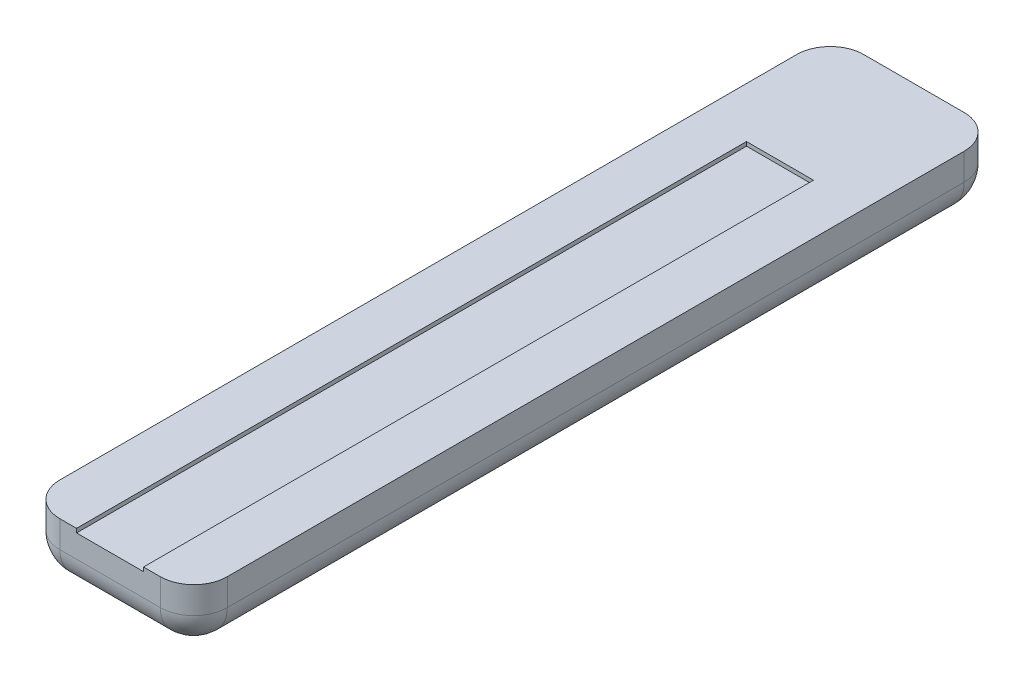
ISO-10303-21;
HEADER;
FILE_DESCRIPTION(('STEP AP214'),'2;1');
FILE_NAME('part.step','',(''),(''),'','','');
FILE_SCHEMA(('AUTOMOTIVE_DESIGN { 1 0 10303 214 1 1 1 1 }'));
ENDSEC;
DATA;
#1=APPLICATION_CONTEXT('core data for automotive mechanical design processes');
#2=APPLICATION_PROTOCOL_DEFINITION('international standard','automotive_design',2000,#1);
#3=PRODUCT_CONTEXT('',#1,'mechanical');
#4=PRODUCT('Part','Part','',(#3));
#5=PRODUCT_RELATED_PRODUCT_CATEGORY('part','',(#4));
#6=PRODUCT_DEFINITION_FORMATION('','',#4);
#7=PRODUCT_DEFINITION_CONTEXT('part definition',#1,'design');
#8=PRODUCT_DEFINITION('design','',#6,#7);
#9=PRODUCT_DEFINITION_SHAPE('','',#8);
#10=(LENGTH_UNIT() NAMED_UNIT(*) SI_UNIT(.MILLI.,.METRE.));
#11=(NAMED_UNIT(*) PLANE_ANGLE_UNIT() SI_UNIT($,.RADIAN.));
#12=(NAMED_UNIT(*) SI_UNIT($,.STERADIAN.) SOLID_ANGLE_UNIT());
#13=UNCERTAINTY_MEASURE_WITH_UNIT(LENGTH_MEASURE(1.E-05),#10,'distance_accuracy_value','');
#14=(GEOMETRIC_REPRESENTATION_CONTEXT(3) GLOBAL_UNCERTAINTY_ASSIGNED_CONTEXT((#13)) GLOBAL_UNIT_ASSIGNED_CONTEXT((#10,
#11,#12)) REPRESENTATION_CONTEXT('',''));
#15=CARTESIAN_POINT('',(0.,0.,0.));
#16=DIRECTION('',(0.,0.,1.));
#17=DIRECTION('',(1.,0.,0.));
#18=AXIS2_PLACEMENT_3D('',#15,#16,#17);
#19=CARTESIAN_POINT('',(-15.875,-11.43,0.));
#20=DIRECTION('',(-1.,0.,0.));
#21=DIRECTION('',(0.,0.,1.));
#22=AXIS2_PLACEMENT_3D('',#19,#20,#21);
#23=PLANE('',#22);
#24=DIRECTION('',(0.,1.,0.));
#25=VECTOR('',#24,1.);
#26=CARTESIAN_POINT('',(-15.875,-11.43,-146.05));
#27=LINE('',#26,#25);
#28=CARTESIAN_POINT('',(-15.875,0.,-146.05));
#29=VERTEX_POINT('',#28);
#30=CARTESIAN_POINT('',(-15.875,-5.08,-146.05));
#31=VERTEX_POINT('',#30);
#32=EDGE_CURVE('E207',#29,#31,#27,.F.);
#33=ORIENTED_EDGE('',*,*,#32,.T.);
#34=DIRECTION('',(0.,0.,1.));
#35=VECTOR('',#34,1.);
#36=CARTESIAN_POINT('',(-15.875,-5.08,0.));
#37=LINE('',#36,#35);
#38=CARTESIAN_POINT('',(-15.875,-5.08,-6.35));
#39=VERTEX_POINT('',#38);
#40=EDGE_CURVE('E217',#31,#39,#37,.T.);
#41=ORIENTED_EDGE('',*,*,#40,.T.);
#42=DIRECTION('',(0.,1.,0.));
#43=VECTOR('',#42,1.);
#44=CARTESIAN_POINT('',(-15.875,-11.43,-6.35));
#45=LINE('',#44,#43);
#46=CARTESIAN_POINT('',(-15.875,0.,-6.35));
#47=VERTEX_POINT('',#46);
#48=EDGE_CURVE('E205',#39,#47,#45,.T.);
#49=ORIENTED_EDGE('',*,*,#48,.T.);
#50=DIRECTION('',(0.,0.,1.));
#51=VECTOR('',#50,1.);
#52=CARTESIAN_POINT('',(-15.875,0.,0.));
#53=LINE('',#52,#51);
#54=EDGE_CURVE('E175',#29,#47,#53,.T.);
#55=ORIENTED_EDGE('',*,*,#54,.F.);
#56=EDGE_LOOP('',(#33,#41,#49,#55));
#57=FACE_BOUND('',#56,.T.);
#58=ADVANCED_FACE('F33',(#57),#23,.T.);
#59=CARTESIAN_POINT('',(-15.875,-11.43,-152.4));
#60=DIRECTION('',(0.,0.,-1.));
#61=DIRECTION('',(-1.,0.,0.));
#62=AXIS2_PLACEMENT_3D('',#59,#60,#61);
#63=PLANE('',#62);
#64=DIRECTION('',(0.,1.,0.));
#65=VECTOR('',#64,1.);
#66=CARTESIAN_POINT('',(9.525,-11.43,-152.4));
#67=LINE('',#66,#65);
#68=CARTESIAN_POINT('',(9.525,0.,-152.4));
#69=VERTEX_POINT('',#68);
#70=CARTESIAN_POINT('',(9.525,-5.08,-152.4));
#71=VERTEX_POINT('',#70);
#72=EDGE_CURVE('E202',#69,#71,#67,.F.);
#73=ORIENTED_EDGE('',*,*,#72,.T.);
#74=DIRECTION('',(-1.,0.,0.));
#75=VECTOR('',#74,1.);
#76=CARTESIAN_POINT('',(-15.875,-5.08,-152.4));
#77=LINE('',#76,#75);
#78=CARTESIAN_POINT('',(-9.525,-5.08,-152.4));
#79=VERTEX_POINT('',#78);
#80=EDGE_CURVE('E230',#71,#79,#77,.T.);
#81=ORIENTED_EDGE('',*,*,#80,.T.);
#82=DIRECTION('',(0.,1.,0.));
#83=VECTOR('',#82,1.);
#84=CARTESIAN_POINT('',(-9.525,-11.43,-152.4));
#85=LINE('',#84,#83);
#86=CARTESIAN_POINT('',(-9.525,0.,-152.4));
#87=VERTEX_POINT('',#86);
#88=EDGE_CURVE('E200',#79,#87,#85,.T.);
#89=ORIENTED_EDGE('',*,*,#88,.T.);
#90=DIRECTION('',(-1.,0.,0.));
#91=VECTOR('',#90,1.);
#92=CARTESIAN_POINT('',(-15.875,0.,-152.4));
#93=LINE('',#92,#91);
#94=EDGE_CURVE('E184',#69,#87,#93,.T.);
#95=ORIENTED_EDGE('',*,*,#94,.F.);
#96=EDGE_LOOP('',(#73,#81,#89,#95));
#97=FACE_BOUND('',#96,.T.);
#98=ADVANCED_FACE('F273',(#97),#63,.T.);
#99=CARTESIAN_POINT('',(15.875,-11.43,0.));
#100=DIRECTION('',(1.,0.,0.));
#101=DIRECTION('',(0.,0.,-1.));
#102=AXIS2_PLACEMENT_3D('',#99,#100,#101);
#103=PLANE('',#102);
#104=DIRECTION('',(0.,1.,0.));
#105=VECTOR('',#104,1.);
#106=CARTESIAN_POINT('',(15.875,-11.43,-6.35));
#107=LINE('',#106,#105);
#108=CARTESIAN_POINT('',(15.875,0.,-6.35));
#109=VERTEX_POINT('',#108);
#110=CARTESIAN_POINT('',(15.875,-5.08,-6.35));
#111=VERTEX_POINT('',#110);
#112=EDGE_CURVE('E187',#109,#111,#107,.F.);
#113=ORIENTED_EDGE('',*,*,#112,.T.);
#114=DIRECTION('',(0.,0.,-1.));
#115=VECTOR('',#114,1.);
#116=CARTESIAN_POINT('',(15.875,-5.08,0.));
#117=LINE('',#116,#115);
#118=CARTESIAN_POINT('',(15.875,-5.08,-146.05));
#119=VERTEX_POINT('',#118);
#120=EDGE_CURVE('E234',#111,#119,#117,.T.);
#121=ORIENTED_EDGE('',*,*,#120,.T.);
#122=DIRECTION('',(0.,1.,0.));
#123=VECTOR('',#122,1.);
#124=CARTESIAN_POINT('',(15.875,-11.43,-146.05));
#125=LINE('',#124,#123);
#126=CARTESIAN_POINT('',(15.875,0.,-146.05));
#127=VERTEX_POINT('',#126);
#128=EDGE_CURVE('E190',#119,#127,#125,.T.);
#129=ORIENTED_EDGE('',*,*,#128,.T.);
#130=DIRECTION('',(0.,0.,-1.));
#131=VECTOR('',#130,1.);
#132=CARTESIAN_POINT('',(15.875,0.,0.));
#133=LINE('',#132,#131);
#134=EDGE_CURVE('E181',#109,#127,#133,.T.);
#135=ORIENTED_EDGE('',*,*,#134,.F.);
#136=EDGE_LOOP('',(#113,#121,#129,#135));
#137=FACE_BOUND('',#136,.T.);
#138=ADVANCED_FACE('F283',(#137),#103,.T.);
#139=CARTESIAN_POINT('',(-15.875,-11.43,0.));
#140=DIRECTION('',(0.,0.,1.));
#141=DIRECTION('',(1.,0.,0.));
#142=AXIS2_PLACEMENT_3D('',#139,#140,#141);
#143=PLANE('',#142);
#144=DIRECTION('',(0.,1.,0.));
#145=VECTOR('',#144,1.);
#146=CARTESIAN_POINT('',(-6.34999999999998,-0.762,0.));
#147=LINE('',#146,#145);
#148=CARTESIAN_POINT('',(-6.34999999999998,-0.762,0.));
#149=VERTEX_POINT('',#148);
#150=CARTESIAN_POINT('',(-6.34999999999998,0.,0.));
#151=VERTEX_POINT('',#150);
#152=EDGE_CURVE('E137',#149,#151,#147,.T.);
#153=ORIENTED_EDGE('',*,*,#152,.T.);
#154=DIRECTION('',(1.,0.,0.));
#155=VECTOR('',#154,1.);
#156=CARTESIAN_POINT('',(-15.875,0.,0.));
#157=LINE('',#156,#155);
#158=CARTESIAN_POINT('',(-9.525,0.,0.));
#159=VERTEX_POINT('',#158);
#160=EDGE_CURVE('E179',#159,#151,#157,.T.);
#161=ORIENTED_EDGE('',*,*,#160,.F.);
#162=DIRECTION('',(0.,1.,0.));
#163=VECTOR('',#162,1.);
#164=CARTESIAN_POINT('',(-9.525,-11.43,0.));
#165=LINE('',#164,#163);
#166=CARTESIAN_POINT('',(-9.525,-5.08,0.));
#167=VERTEX_POINT('',#166);
#168=EDGE_CURVE('E212',#159,#167,#165,.F.);
#169=ORIENTED_EDGE('',*,*,#168,.T.);
#170=DIRECTION('',(1.,0.,0.));
#171=VECTOR('',#170,1.);
#172=CARTESIAN_POINT('',(-15.875,-5.08,0.));
#173=LINE('',#172,#171);
#174=CARTESIAN_POINT('',(9.525,-5.08,0.));
#175=VERTEX_POINT('',#174);
#176=EDGE_CURVE('E11',#167,#175,#173,.T.);
#177=ORIENTED_EDGE('',*,*,#176,.T.);
#178=DIRECTION('',(0.,1.,0.));
#179=VECTOR('',#178,1.);
#180=CARTESIAN_POINT('',(9.525,-11.43,0.));
#181=LINE('',#180,#179);
#182=CARTESIAN_POINT('',(9.525,0.,0.));
#183=VERTEX_POINT('',#182);
#184=EDGE_CURVE('E210',#175,#183,#181,.T.);
#185=ORIENTED_EDGE('',*,*,#184,.T.);
#186=CARTESIAN_POINT('',(6.35000000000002,0.,0.));
#187=VERTEX_POINT('',#186);
#188=EDGE_CURVE('E178',#187,#183,#157,.T.);
#189=ORIENTED_EDGE('',*,*,#188,.F.);
#190=DIRECTION('',(0.,1.,0.));
#191=VECTOR('',#190,1.);
#192=CARTESIAN_POINT('',(6.35000000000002,-0.762,0.));
#193=LINE('',#192,#191);
#194=CARTESIAN_POINT('',(6.35000000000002,-0.762,0.));
#195=VERTEX_POINT('',#194);
#196=EDGE_CURVE('E50',#195,#187,#193,.T.);
#197=ORIENTED_EDGE('',*,*,#196,.F.);
#198=DIRECTION('',(1.,0.,0.));
#199=VECTOR('',#198,1.);
#200=CARTESIAN_POINT('',(-6.34999999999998,-0.762,0.));
#201=LINE('',#200,#199);
#202=EDGE_CURVE('E153',#149,#195,#201,.T.);
#203=ORIENTED_EDGE('',*,*,#202,.F.);
#204=EDGE_LOOP('',(#153,#161,#169,#177,#185,#189,#197,#203));
#205=FACE_BOUND('',#204,.T.);
#206=ADVANCED_FACE('F157',(#205),#143,.T.);
#207=CARTESIAN_POINT('',(-15.875,-11.43,-152.4));
#208=DIRECTION('',(0.,-1.,0.));
#209=DIRECTION('',(0.,0.,-1.));
#210=AXIS2_PLACEMENT_3D('',#207,#208,#209);
#211=PLANE('',#210);
#212=DIRECTION('',(1.,0.,0.));
#213=VECTOR('',#212,1.);
#214=CARTESIAN_POINT('',(-15.875,-11.43,-6.34999999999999));
#215=LINE('',#214,#213);
#216=CARTESIAN_POINT('',(9.525,-11.43,-6.35));
#217=VERTEX_POINT('',#216);
#218=CARTESIAN_POINT('',(-9.525,-11.43,-6.35));
#219=VERTEX_POINT('',#218);
#220=EDGE_CURVE('E219',#217,#219,#215,.F.);
#221=ORIENTED_EDGE('',*,*,#220,.T.);
#222=DIRECTION('',(0.,0.,1.));
#223=VECTOR('',#222,1.);
#224=CARTESIAN_POINT('',(-9.525,-11.43,-152.4));
#225=LINE('',#224,#223);
#226=CARTESIAN_POINT('',(-9.525,-11.43,-146.05));
#227=VERTEX_POINT('',#226);
#228=EDGE_CURVE('E225',#219,#227,#225,.F.);
#229=ORIENTED_EDGE('',*,*,#228,.T.);
#230=DIRECTION('',(-1.,0.,0.));
#231=VECTOR('',#230,1.);
#232=CARTESIAN_POINT('',(-15.875,-11.43,-146.05));
#233=LINE('',#232,#231);
#234=CARTESIAN_POINT('',(9.525,-11.43,-146.05));
#235=VERTEX_POINT('',#234);
#236=EDGE_CURVE('E223',#227,#235,#233,.F.);
#237=ORIENTED_EDGE('',*,*,#236,.T.);
#238=DIRECTION('',(0.,0.,-1.));
#239=VECTOR('',#238,1.);
#240=CARTESIAN_POINT('',(9.525,-11.43,-152.4));
#241=LINE('',#240,#239);
#242=EDGE_CURVE('E221',#235,#217,#241,.F.);
#243=ORIENTED_EDGE('',*,*,#242,.T.);
#244=EDGE_LOOP('',(#221,#229,#237,#243));
#245=FACE_BOUND('',#244,.T.);
#246=ADVANCED_FACE('F296',(#245),#211,.T.);
#247=CARTESIAN_POINT('',(-15.875,0.,-152.4));
#248=DIRECTION('',(0.,-1.,0.));
#249=DIRECTION('',(0.,0.,-1.));
#250=AXIS2_PLACEMENT_3D('',#247,#248,#249);
#251=PLANE('',#250);
#252=ORIENTED_EDGE('',*,*,#160,.T.);
#253=DIRECTION('',(0.,0.,1.));
#254=VECTOR('',#253,1.);
#255=CARTESIAN_POINT('',(-6.34999999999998,0.,0.));
#256=LINE('',#255,#254);
#257=CARTESIAN_POINT('',(-6.34999999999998,0.,-127.));
#258=VERTEX_POINT('',#257);
#259=EDGE_CURVE('E143',#258,#151,#256,.T.);
#260=ORIENTED_EDGE('',*,*,#259,.F.);
#261=DIRECTION('',(-1.,0.,0.));
#262=VECTOR('',#261,1.);
#263=CARTESIAN_POINT('',(-6.34999999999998,0.,-127.));
#264=LINE('',#263,#262);
#265=CARTESIAN_POINT('',(6.34999999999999,0.,-127.));
#266=VERTEX_POINT('',#265);
#267=EDGE_CURVE('E155',#266,#258,#264,.T.);
#268=ORIENTED_EDGE('',*,*,#267,.F.);
#269=DIRECTION('',(0.,0.,-1.));
#270=VECTOR('',#269,1.);
#271=CARTESIAN_POINT('',(6.35000000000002,0.,0.));
#272=LINE('',#271,#270);
#273=EDGE_CURVE('E165',#187,#266,#272,.T.);
#274=ORIENTED_EDGE('',*,*,#273,.F.);
#275=ORIENTED_EDGE('',*,*,#188,.T.);
#276=CARTESIAN_POINT('',(9.525,0.,-6.35));
#277=DIRECTION('',(0.,-1.,0.));
#278=DIRECTION('',(0.,0.,-1.));
#279=AXIS2_PLACEMENT_3D('',#276,#277,#278);
#280=CIRCLE('',#279,6.35);
#281=EDGE_CURVE('E192',#183,#109,#280,.F.);
#282=ORIENTED_EDGE('',*,*,#281,.T.);
#283=ORIENTED_EDGE('',*,*,#134,.T.);
#284=CARTESIAN_POINT('',(9.525,0.,-146.05));
#285=DIRECTION('',(0.,-1.,0.));
#286=DIRECTION('',(0.,0.,-1.));
#287=AXIS2_PLACEMENT_3D('',#284,#285,#286);
#288=CIRCLE('',#287,6.35);
#289=EDGE_CURVE('E198',#127,#69,#288,.F.);
#290=ORIENTED_EDGE('',*,*,#289,.T.);
#291=ORIENTED_EDGE('',*,*,#94,.T.);
#292=CARTESIAN_POINT('',(-9.525,0.,-146.05));
#293=DIRECTION('',(0.,-1.,0.));
#294=DIRECTION('',(0.,0.,-1.));
#295=AXIS2_PLACEMENT_3D('',#292,#293,#294);
#296=CIRCLE('',#295,6.35);
#297=EDGE_CURVE('E196',#87,#29,#296,.F.);
#298=ORIENTED_EDGE('',*,*,#297,.T.);
#299=ORIENTED_EDGE('',*,*,#54,.T.);
#300=CARTESIAN_POINT('',(-9.525,0.,-6.35));
#301=DIRECTION('',(0.,-1.,0.));
#302=DIRECTION('',(0.,0.,-1.));
#303=AXIS2_PLACEMENT_3D('',#300,#301,#302);
#304=CIRCLE('',#303,6.35);
#305=EDGE_CURVE('E194',#47,#159,#304,.F.);
#306=ORIENTED_EDGE('',*,*,#305,.T.);
#307=EDGE_LOOP('',(#252,#260,#268,#274,#275,#282,#283,#290,#291,#298,#299,#306));
#308=FACE_BOUND('',#307,.T.);
#309=ADVANCED_FACE('F277',(#308),#251,.F.);
#310=CARTESIAN_POINT('',(9.525,-11.43,-146.05));
#311=DIRECTION('',(0.,1.,0.));
#312=DIRECTION('',(0.,0.,1.));
#313=AXIS2_PLACEMENT_3D('',#310,#311,#312);
#314=CYLINDRICAL_SURFACE('',#313,6.35);
#315=ORIENTED_EDGE('',*,*,#128,.F.);
#316=CARTESIAN_POINT('',(9.525,-5.08,-146.05));
#317=DIRECTION('',(0.,1.,0.));
#318=DIRECTION('',(0.,0.,1.));
#319=AXIS2_PLACEMENT_3D('',#316,#317,#318);
#320=CIRCLE('',#319,6.35);
#321=EDGE_CURVE('E232',#119,#71,#320,.T.);
#322=ORIENTED_EDGE('',*,*,#321,.T.);
#323=ORIENTED_EDGE('',*,*,#72,.F.);
#324=ORIENTED_EDGE('',*,*,#289,.F.);
#325=EDGE_LOOP('',(#315,#322,#323,#324));
#326=FACE_BOUND('',#325,.T.);
#327=ADVANCED_FACE('F269',(#326),#314,.T.);
#328=CARTESIAN_POINT('',(-9.525,-11.43,-146.05));
#329=DIRECTION('',(0.,1.,0.));
#330=DIRECTION('',(0.,0.,1.));
#331=AXIS2_PLACEMENT_3D('',#328,#329,#330);
#332=CYLINDRICAL_SURFACE('',#331,6.35);
#333=ORIENTED_EDGE('',*,*,#88,.F.);
#334=CARTESIAN_POINT('',(-9.525,-5.08,-146.05));
#335=DIRECTION('',(0.,1.,0.));
#336=DIRECTION('',(0.,0.,1.));
#337=AXIS2_PLACEMENT_3D('',#334,#335,#336);
#338=CIRCLE('',#337,6.35);
#339=EDGE_CURVE('E228',#79,#31,#338,.T.);
#340=ORIENTED_EDGE('',*,*,#339,.T.);
#341=ORIENTED_EDGE('',*,*,#32,.F.);
#342=ORIENTED_EDGE('',*,*,#297,.F.);
#343=EDGE_LOOP('',(#333,#340,#341,#342));
#344=FACE_BOUND('',#343,.T.);
#345=ADVANCED_FACE('F326',(#344),#332,.T.);
#346=CARTESIAN_POINT('',(-9.525,-11.43,-6.35));
#347=DIRECTION('',(0.,1.,0.));
#348=DIRECTION('',(0.,0.,1.));
#349=AXIS2_PLACEMENT_3D('',#346,#347,#348);
#350=CYLINDRICAL_SURFACE('',#349,6.35);
#351=ORIENTED_EDGE('',*,*,#48,.F.);
#352=CARTESIAN_POINT('',(-9.525,-5.08,-6.35));
#353=DIRECTION('',(0.,1.,0.));
#354=DIRECTION('',(0.,0.,1.));
#355=AXIS2_PLACEMENT_3D('',#352,#353,#354);
#356=CIRCLE('',#355,6.35);
#357=EDGE_CURVE('E214',#39,#167,#356,.T.);
#358=ORIENTED_EDGE('',*,*,#357,.T.);
#359=ORIENTED_EDGE('',*,*,#168,.F.);
#360=ORIENTED_EDGE('',*,*,#305,.F.);
#361=EDGE_LOOP('',(#351,#358,#359,#360));
#362=FACE_BOUND('',#361,.T.);
#363=ADVANCED_FACE('F329',(#362),#350,.T.);
#364=CARTESIAN_POINT('',(9.525,-11.43,-6.35));
#365=DIRECTION('',(0.,1.,0.));
#366=DIRECTION('',(0.,0.,1.));
#367=AXIS2_PLACEMENT_3D('',#364,#365,#366);
#368=CYLINDRICAL_SURFACE('',#367,6.35);
#369=ORIENTED_EDGE('',*,*,#184,.F.);
#370=CARTESIAN_POINT('',(9.525,-5.08,-6.35));
#371=DIRECTION('',(0.,1.,0.));
#372=DIRECTION('',(0.,0.,1.));
#373=AXIS2_PLACEMENT_3D('',#370,#371,#372);
#374=CIRCLE('',#373,6.35);
#375=EDGE_CURVE('E42',#175,#111,#374,.T.);
#376=ORIENTED_EDGE('',*,*,#375,.T.);
#377=ORIENTED_EDGE('',*,*,#112,.F.);
#378=ORIENTED_EDGE('',*,*,#281,.F.);
#379=EDGE_LOOP('',(#369,#376,#377,#378));
#380=FACE_BOUND('',#379,.T.);
#381=ADVANCED_FACE('F285',(#380),#368,.T.);
#382=CARTESIAN_POINT('',(9.525,-5.08,-146.05));
#383=DIRECTION('',(0.,0.,1.));
#384=DIRECTION('',(1.,0.,0.));
#385=AXIS2_PLACEMENT_3D('',#382,#383,#384);
#386=SPHERICAL_SURFACE('',#385,6.35);
#387=CARTESIAN_POINT('',(9.525,-5.08,-146.05));
#388=DIRECTION('',(-1.,0.,0.));
#389=DIRECTION('',(0.,0.,1.));
#390=AXIS2_PLACEMENT_3D('',#387,#388,#389);
#391=CIRCLE('',#390,6.35);
#392=EDGE_CURVE('E251',#71,#235,#391,.T.);
#393=ORIENTED_EDGE('',*,*,#392,.F.);
#394=ORIENTED_EDGE('',*,*,#321,.F.);
#395=CARTESIAN_POINT('',(9.525,-5.08,-146.05));
#396=DIRECTION('',(0.,0.,1.));
#397=DIRECTION('',(1.,0.,0.));
#398=AXIS2_PLACEMENT_3D('',#395,#396,#397);
#399=CIRCLE('',#398,6.35);
#400=EDGE_CURVE('E37',#235,#119,#399,.T.);
#401=ORIENTED_EDGE('',*,*,#400,.F.);
#402=EDGE_LOOP('',(#393,#394,#401));
#403=FACE_BOUND('',#402,.T.);
#404=ADVANCED_FACE('F35',(#403),#386,.T.);
#405=CARTESIAN_POINT('',(9.525,-5.08,0.));
#406=DIRECTION('',(0.,0.,-1.));
#407=DIRECTION('',(-1.,0.,0.));
#408=AXIS2_PLACEMENT_3D('',#405,#406,#407);
#409=CYLINDRICAL_SURFACE('',#408,6.35);
#410=ORIENTED_EDGE('',*,*,#400,.T.);
#411=ORIENTED_EDGE('',*,*,#120,.F.);
#412=CARTESIAN_POINT('',(9.525,-5.08,-6.35));
#413=DIRECTION('',(0.,0.,1.));
#414=DIRECTION('',(1.,0.,0.));
#415=AXIS2_PLACEMENT_3D('',#412,#413,#414);
#416=CIRCLE('',#415,6.35);
#417=EDGE_CURVE('E249',#217,#111,#416,.T.);
#418=ORIENTED_EDGE('',*,*,#417,.F.);
#419=ORIENTED_EDGE('',*,*,#242,.F.);
#420=EDGE_LOOP('',(#410,#411,#418,#419));
#421=FACE_BOUND('',#420,.T.);
#422=ADVANCED_FACE('F262',(#421),#409,.T.);
#423=CARTESIAN_POINT('',(-15.875,-5.08,-146.05));
#424=DIRECTION('',(-1.,0.,0.));
#425=DIRECTION('',(0.,0.,1.));
#426=AXIS2_PLACEMENT_3D('',#423,#424,#425);
#427=CYLINDRICAL_SURFACE('',#426,6.35);
#428=ORIENTED_EDGE('',*,*,#392,.T.);
#429=ORIENTED_EDGE('',*,*,#236,.F.);
#430=CARTESIAN_POINT('',(-9.525,-5.08,-146.05));
#431=DIRECTION('',(-1.,0.,0.));
#432=DIRECTION('',(0.,0.,1.));
#433=AXIS2_PLACEMENT_3D('',#430,#431,#432);
#434=CIRCLE('',#433,6.35);
#435=EDGE_CURVE('E246',#79,#227,#434,.T.);
#436=ORIENTED_EDGE('',*,*,#435,.F.);
#437=ORIENTED_EDGE('',*,*,#80,.F.);
#438=EDGE_LOOP('',(#428,#429,#436,#437));
#439=FACE_BOUND('',#438,.T.);
#440=ADVANCED_FACE('F306',(#439),#427,.T.);
#441=CARTESIAN_POINT('',(9.525,-5.08,-6.35));
#442=DIRECTION('',(0.,0.,1.));
#443=DIRECTION('',(1.,0.,0.));
#444=AXIS2_PLACEMENT_3D('',#441,#442,#443);
#445=SPHERICAL_SURFACE('',#444,6.35);
#446=ORIENTED_EDGE('',*,*,#417,.T.);
#447=ORIENTED_EDGE('',*,*,#375,.F.);
#448=CARTESIAN_POINT('',(9.525,-5.08,-6.35));
#449=DIRECTION('',(-1.,0.,0.));
#450=DIRECTION('',(0.,0.,1.));
#451=AXIS2_PLACEMENT_3D('',#448,#449,#450);
#452=CIRCLE('',#451,6.35);
#453=EDGE_CURVE('E243',#217,#175,#452,.T.);
#454=ORIENTED_EDGE('',*,*,#453,.F.);
#455=EDGE_LOOP('',(#446,#447,#454));
#456=FACE_BOUND('',#455,.T.);
#457=ADVANCED_FACE('F289',(#456),#445,.T.);
#458=CARTESIAN_POINT('',(-9.525,-5.08,-146.05));
#459=DIRECTION('',(0.,0.,1.));
#460=DIRECTION('',(1.,0.,0.));
#461=AXIS2_PLACEMENT_3D('',#458,#459,#460);
#462=SPHERICAL_SURFACE('',#461,6.35);
#463=ORIENTED_EDGE('',*,*,#339,.F.);
#464=ORIENTED_EDGE('',*,*,#435,.T.);
#465=CARTESIAN_POINT('',(-9.525,-5.08,-146.05));
#466=DIRECTION('',(0.,0.,1.));
#467=DIRECTION('',(1.,0.,0.));
#468=AXIS2_PLACEMENT_3D('',#465,#466,#467);
#469=CIRCLE('',#468,6.35);
#470=EDGE_CURVE('E241',#31,#227,#469,.T.);
#471=ORIENTED_EDGE('',*,*,#470,.F.);
#472=EDGE_LOOP('',(#463,#464,#471));
#473=FACE_BOUND('',#472,.T.);
#474=ADVANCED_FACE('F305',(#473),#462,.T.);
#475=CARTESIAN_POINT('',(-15.875,-5.08,-6.35));
#476=DIRECTION('',(1.,0.,0.));
#477=DIRECTION('',(0.,0.,-1.));
#478=AXIS2_PLACEMENT_3D('',#475,#476,#477);
#479=CYLINDRICAL_SURFACE('',#478,6.35);
#480=ORIENTED_EDGE('',*,*,#453,.T.);
#481=ORIENTED_EDGE('',*,*,#176,.F.);
#482=CARTESIAN_POINT('',(-9.525,-5.08,-6.35));
#483=DIRECTION('',(-1.,0.,0.));
#484=DIRECTION('',(0.,0.,1.));
#485=AXIS2_PLACEMENT_3D('',#482,#483,#484);
#486=CIRCLE('',#485,6.35);
#487=EDGE_CURVE('E239',#219,#167,#486,.T.);
#488=ORIENTED_EDGE('',*,*,#487,.F.);
#489=ORIENTED_EDGE('',*,*,#220,.F.);
#490=EDGE_LOOP('',(#480,#481,#488,#489));
#491=FACE_BOUND('',#490,.T.);
#492=ADVANCED_FACE('F292',(#491),#479,.T.);
#493=CARTESIAN_POINT('',(-9.525,-5.08,0.));
#494=DIRECTION('',(0.,0.,1.));
#495=DIRECTION('',(1.,0.,0.));
#496=AXIS2_PLACEMENT_3D('',#493,#494,#495);
#497=CYLINDRICAL_SURFACE('',#496,6.35);
#498=ORIENTED_EDGE('',*,*,#470,.T.);
#499=ORIENTED_EDGE('',*,*,#228,.F.);
#500=CARTESIAN_POINT('',(-9.525,-5.08,-6.35));
#501=DIRECTION('',(0.,0.,1.));
#502=DIRECTION('',(1.,0.,0.));
#503=AXIS2_PLACEMENT_3D('',#500,#501,#502);
#504=CIRCLE('',#503,6.35);
#505=EDGE_CURVE('E171',#39,#219,#504,.T.);
#506=ORIENTED_EDGE('',*,*,#505,.F.);
#507=ORIENTED_EDGE('',*,*,#40,.F.);
#508=EDGE_LOOP('',(#498,#499,#506,#507));
#509=FACE_BOUND('',#508,.T.);
#510=ADVANCED_FACE('F299',(#509),#497,.T.);
#511=CARTESIAN_POINT('',(-9.525,-5.08,-6.35));
#512=DIRECTION('',(0.,0.,1.));
#513=DIRECTION('',(1.,0.,0.));
#514=AXIS2_PLACEMENT_3D('',#511,#512,#513);
#515=SPHERICAL_SURFACE('',#514,6.35);
#516=ORIENTED_EDGE('',*,*,#487,.T.);
#517=ORIENTED_EDGE('',*,*,#357,.F.);
#518=ORIENTED_EDGE('',*,*,#505,.T.);
#519=EDGE_LOOP('',(#516,#517,#518));
#520=FACE_BOUND('',#519,.T.);
#521=ADVANCED_FACE('F336',(#520),#515,.T.);
#522=CARTESIAN_POINT('',(-6.34999999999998,-0.762,0.));
#523=DIRECTION('',(-1.,0.,0.));
#524=DIRECTION('',(0.,0.,1.));
#525=AXIS2_PLACEMENT_3D('',#522,#523,#524);
#526=PLANE('',#525);
#527=ORIENTED_EDGE('',*,*,#259,.T.);
#528=ORIENTED_EDGE('',*,*,#152,.F.);
#529=DIRECTION('',(0.,0.,1.));
#530=VECTOR('',#529,1.);
#531=CARTESIAN_POINT('',(-6.34999999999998,-0.762,0.));
#532=LINE('',#531,#530);
#533=CARTESIAN_POINT('',(-6.34999999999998,-0.762,-127.));
#534=VERTEX_POINT('',#533);
#535=EDGE_CURVE('E140',#534,#149,#532,.T.);
#536=ORIENTED_EDGE('',*,*,#535,.F.);
#537=DIRECTION('',(0.,1.,0.));
#538=VECTOR('',#537,1.);
#539=CARTESIAN_POINT('',(-6.34999999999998,-0.762,-127.));
#540=LINE('',#539,#538);
#541=EDGE_CURVE('E169',#534,#258,#540,.T.);
#542=ORIENTED_EDGE('',*,*,#541,.T.);
#543=EDGE_LOOP('',(#527,#528,#536,#542));
#544=FACE_BOUND('',#543,.T.);
#545=ADVANCED_FACE('F139',(#544),#526,.F.);
#546=CARTESIAN_POINT('',(-6.34999999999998,-0.762,-127.));
#547=DIRECTION('',(0.,0.,-1.));
#548=DIRECTION('',(-1.,0.,0.));
#549=AXIS2_PLACEMENT_3D('',#546,#547,#548);
#550=PLANE('',#549);
#551=ORIENTED_EDGE('',*,*,#267,.T.);
#552=ORIENTED_EDGE('',*,*,#541,.F.);
#553=DIRECTION('',(-1.,0.,0.));
#554=VECTOR('',#553,1.);
#555=CARTESIAN_POINT('',(-6.34999999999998,-0.762,-127.));
#556=LINE('',#555,#554);
#557=CARTESIAN_POINT('',(6.34999999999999,-0.762,-127.));
#558=VERTEX_POINT('',#557);
#559=EDGE_CURVE('E147',#558,#534,#556,.T.);
#560=ORIENTED_EDGE('',*,*,#559,.F.);
#561=DIRECTION('',(0.,1.,0.));
#562=VECTOR('',#561,1.);
#563=CARTESIAN_POINT('',(6.34999999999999,-0.762,-127.));
#564=LINE('',#563,#562);
#565=EDGE_CURVE('E172',#558,#266,#564,.T.);
#566=ORIENTED_EDGE('',*,*,#565,.T.);
#567=EDGE_LOOP('',(#551,#552,#560,#566));
#568=FACE_BOUND('',#567,.T.);
#569=ADVANCED_FACE('F368',(#568),#550,.F.);
#570=CARTESIAN_POINT('',(6.35000000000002,-0.762,0.));
#571=DIRECTION('',(1.,0.,0.));
#572=DIRECTION('',(0.,0.,-1.));
#573=AXIS2_PLACEMENT_3D('',#570,#571,#572);
#574=PLANE('',#573);
#575=ORIENTED_EDGE('',*,*,#273,.T.);
#576=ORIENTED_EDGE('',*,*,#565,.F.);
#577=DIRECTION('',(0.,0.,-1.));
#578=VECTOR('',#577,1.);
#579=CARTESIAN_POINT('',(6.35000000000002,-0.762,0.));
#580=LINE('',#579,#578);
#581=EDGE_CURVE('E159',#195,#558,#580,.T.);
#582=ORIENTED_EDGE('',*,*,#581,.F.);
#583=ORIENTED_EDGE('',*,*,#196,.T.);
#584=EDGE_LOOP('',(#575,#576,#582,#583));
#585=FACE_BOUND('',#584,.T.);
#586=ADVANCED_FACE('F376',(#585),#574,.F.);
#587=CARTESIAN_POINT('',(-6.34999999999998,-0.762,-127.));
#588=DIRECTION('',(0.,-1.,0.));
#589=DIRECTION('',(0.,0.,-1.));
#590=AXIS2_PLACEMENT_3D('',#587,#588,#589);
#591=PLANE('',#590);
#592=ORIENTED_EDGE('',*,*,#535,.T.);
#593=ORIENTED_EDGE('',*,*,#202,.T.);
#594=ORIENTED_EDGE('',*,*,#581,.T.);
#595=ORIENTED_EDGE('',*,*,#559,.T.);
#596=EDGE_LOOP('',(#592,#593,#594,#595));
#597=FACE_BOUND('',#596,.T.);
#598=ADVANCED_FACE('F151',(#597),#591,.F.);
#599=CLOSED_SHELL('',(#58,#98,#138,#206,#246,#309,#327,#345,#363,#381,#404,#422,#440,#457,#474,
#492,#510,#521,#545,#569,#586,#598));
#600=MANIFOLD_SOLID_BREP('B2',#599);
#601=ADVANCED_BREP_SHAPE_REPRESENTATION('',(#18,#600),#14);
#602=SHAPE_DEFINITION_REPRESENTATION(#9,#601);
ENDSEC;
END-ISO-10303-21;
